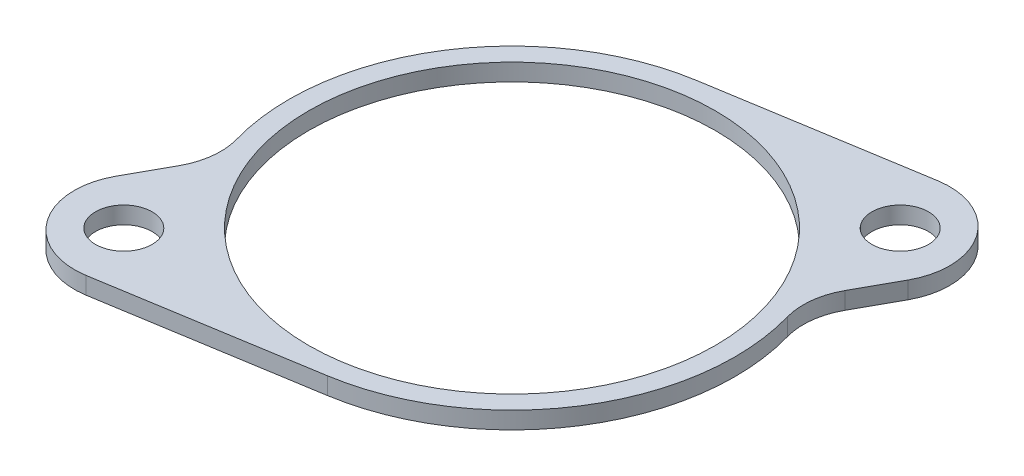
from build123d import *

# Parameters (mm, degrees)
SKETCH1_R           = 11.85
SKETCH1_R_2         = 1.65
BOSS_EXTRUDE1_DEPTH = 1
FILLET1_R           = 4


with BuildPart() as part:
    # Sketch1 → Boss-Extrude1 (new body)
    with BuildSketch(Plane(origin=(0, 0, 0), x_dir=(1, 0, 0), z_dir=(0, 1, 0))):
        with BuildLine():
            Line((12, 5), (18.133329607, 16.121268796))
            Line((18.133329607, 16.121268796), (-2.087671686, 12.831275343))
            ThreePointArc((-2.087671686, 12.831275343), (-11.362403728, 6.316310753), (-12, -5))
            Line((-12, -5), (-18.133329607, -16.121268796))
            Line((-18.133329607, -16.121268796), (2.087671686, -12.831275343))
            ThreePointArc((2.087671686, -12.831275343), (11.362403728, -6.316310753), (12, 5))
        make_face()
        with Locations(Location((0, 0, 0), (0, 0, 270))):
            Circle(SKETCH1_R, mode=Mode.SUBTRACT)
        with Locations(Location((11.313708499, 11.313708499, 0), (0, 0, 270))):
            Circle(SKETCH1_R_2, mode=Mode.SUBTRACT)
        with Locations(Location((-11.313708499, -11.313708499, 0), (0, 0, 270))):
            Circle(SKETCH1_R_2, mode=Mode.SUBTRACT)
    extrude(amount=BOSS_EXTRUDE1_DEPTH)

    # Fillet1
    fillet1_edges = [part.edges().sort_by_distance(p)[0] for p in [
        (-18.133329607, 0.5, 16.121268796),
        (-12, 0.5, 5),
        (18.133329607, 0.5, -16.121268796),
        (12, 0.5, -5),
    ]]
    fillet(fillet1_edges, radius=FILLET1_R)


solid = part.part
